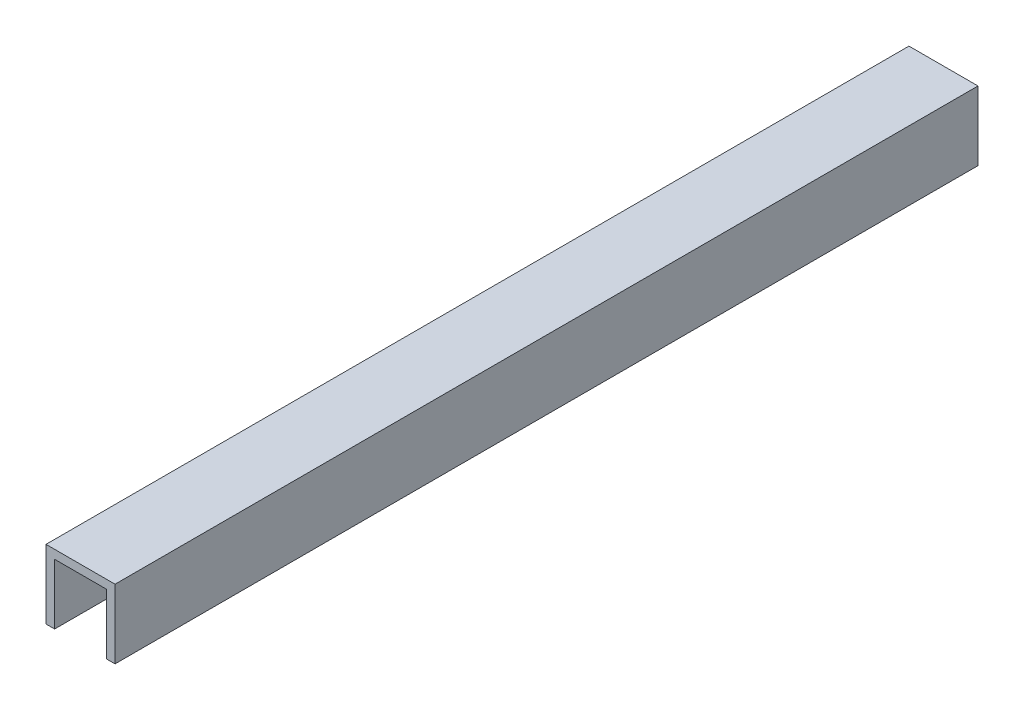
ISO-10303-21;
HEADER;
FILE_DESCRIPTION(('STEP AP214'),'2;1');
FILE_NAME('part.step','',(''),(''),'','','');
FILE_SCHEMA(('AUTOMOTIVE_DESIGN { 1 0 10303 214 1 1 1 1 }'));
ENDSEC;
DATA;
#1=APPLICATION_CONTEXT('core data for automotive mechanical design processes');
#2=APPLICATION_PROTOCOL_DEFINITION('international standard','automotive_design',2000,#1);
#3=PRODUCT_CONTEXT('',#1,'mechanical');
#4=PRODUCT('Part','Part','',(#3));
#5=PRODUCT_RELATED_PRODUCT_CATEGORY('part','',(#4));
#6=PRODUCT_DEFINITION_FORMATION('','',#4);
#7=PRODUCT_DEFINITION_CONTEXT('part definition',#1,'design');
#8=PRODUCT_DEFINITION('design','',#6,#7);
#9=PRODUCT_DEFINITION_SHAPE('','',#8);
#10=(LENGTH_UNIT() NAMED_UNIT(*) SI_UNIT(.MILLI.,.METRE.));
#11=(NAMED_UNIT(*) PLANE_ANGLE_UNIT() SI_UNIT($,.RADIAN.));
#12=(NAMED_UNIT(*) SI_UNIT($,.STERADIAN.) SOLID_ANGLE_UNIT());
#13=UNCERTAINTY_MEASURE_WITH_UNIT(LENGTH_MEASURE(1.E-05),#10,'distance_accuracy_value','');
#14=(GEOMETRIC_REPRESENTATION_CONTEXT(3) GLOBAL_UNCERTAINTY_ASSIGNED_CONTEXT((#13)) GLOBAL_UNIT_ASSIGNED_CONTEXT((#10,
#11,#12)) REPRESENTATION_CONTEXT('',''));
#15=CARTESIAN_POINT('',(0.,0.,0.));
#16=DIRECTION('',(0.,0.,1.));
#17=DIRECTION('',(1.,0.,0.));
#18=AXIS2_PLACEMENT_3D('',#15,#16,#17);
#19=CARTESIAN_POINT('',(4.,-4.,50.));
#20=DIRECTION('',(0.,-1.,0.));
#21=DIRECTION('',(1.,0.,0.));
#22=AXIS2_PLACEMENT_3D('',#19,#20,#21);
#23=PLANE('',#22);
#24=DIRECTION('',(-1.,0.,0.));
#25=VECTOR('',#24,1.);
#26=CARTESIAN_POINT('',(4.,-4.,50.));
#27=LINE('',#26,#25);
#28=CARTESIAN_POINT('',(4.,-4.,50.));
#29=VERTEX_POINT('',#28);
#30=CARTESIAN_POINT('',(3.,-4.,50.));
#31=VERTEX_POINT('',#30);
#32=EDGE_CURVE('E123',#29,#31,#27,.T.);
#33=ORIENTED_EDGE('',*,*,#32,.T.);
#34=DIRECTION('',(0.,0.,-1.));
#35=VECTOR('',#34,1.);
#36=CARTESIAN_POINT('',(3.,-4.,50.));
#37=LINE('',#36,#35);
#38=CARTESIAN_POINT('',(3.,-4.,-50.));
#39=VERTEX_POINT('',#38);
#40=EDGE_CURVE('E112',#31,#39,#37,.T.);
#41=ORIENTED_EDGE('',*,*,#40,.T.);
#42=DIRECTION('',(-1.,0.,0.));
#43=VECTOR('',#42,1.);
#44=CARTESIAN_POINT('',(4.,-4.,-50.));
#45=LINE('',#44,#43);
#46=CARTESIAN_POINT('',(4.,-4.,-50.));
#47=VERTEX_POINT('',#46);
#48=EDGE_CURVE('E121',#47,#39,#45,.T.);
#49=ORIENTED_EDGE('',*,*,#48,.F.);
#50=DIRECTION('',(0.,0.,-1.));
#51=VECTOR('',#50,1.);
#52=CARTESIAN_POINT('',(4.,-4.,50.));
#53=LINE('',#52,#51);
#54=EDGE_CURVE('E59',#29,#47,#53,.T.);
#55=ORIENTED_EDGE('',*,*,#54,.F.);
#56=EDGE_LOOP('',(#33,#41,#49,#55));
#57=FACE_BOUND('',#56,.T.);
#58=ADVANCED_FACE('F35',(#57),#23,.T.);
#59=CARTESIAN_POINT('',(4.,-4.,50.));
#60=DIRECTION('',(-1.,0.,0.));
#61=DIRECTION('',(0.,0.,1.));
#62=AXIS2_PLACEMENT_3D('',#59,#60,#61);
#63=PLANE('',#62);
#64=DIRECTION('',(0.,1.,0.));
#65=VECTOR('',#64,1.);
#66=CARTESIAN_POINT('',(4.,-4.,-50.));
#67=LINE('',#66,#65);
#68=CARTESIAN_POINT('',(4.,4.,-50.));
#69=VERTEX_POINT('',#68);
#70=EDGE_CURVE('E128',#47,#69,#67,.T.);
#71=ORIENTED_EDGE('',*,*,#70,.T.);
#72=DIRECTION('',(0.,0.,-1.));
#73=VECTOR('',#72,1.);
#74=CARTESIAN_POINT('',(4.,4.,50.));
#75=LINE('',#74,#73);
#76=CARTESIAN_POINT('',(4.,4.,50.));
#77=VERTEX_POINT('',#76);
#78=EDGE_CURVE('E11',#77,#69,#75,.T.);
#79=ORIENTED_EDGE('',*,*,#78,.F.);
#80=DIRECTION('',(0.,1.,0.));
#81=VECTOR('',#80,1.);
#82=CARTESIAN_POINT('',(4.,-4.,50.));
#83=LINE('',#82,#81);
#84=EDGE_CURVE('E129',#29,#77,#83,.T.);
#85=ORIENTED_EDGE('',*,*,#84,.F.);
#86=ORIENTED_EDGE('',*,*,#54,.T.);
#87=EDGE_LOOP('',(#71,#79,#85,#86));
#88=FACE_BOUND('',#87,.T.);
#89=ADVANCED_FACE('F37',(#88),#63,.F.);
#90=CARTESIAN_POINT('',(4.,4.,50.));
#91=DIRECTION('',(0.,-1.,0.));
#92=DIRECTION('',(1.,0.,0.));
#93=AXIS2_PLACEMENT_3D('',#90,#91,#92);
#94=PLANE('',#93);
#95=DIRECTION('',(-1.,0.,0.));
#96=VECTOR('',#95,1.);
#97=CARTESIAN_POINT('',(4.,4.,-50.));
#98=LINE('',#97,#96);
#99=CARTESIAN_POINT('',(-4.,4.,-50.));
#100=VERTEX_POINT('',#99);
#101=EDGE_CURVE('E149',#69,#100,#98,.T.);
#102=ORIENTED_EDGE('',*,*,#101,.T.);
#103=DIRECTION('',(0.,0.,-1.));
#104=VECTOR('',#103,1.);
#105=CARTESIAN_POINT('',(-4.,4.,50.));
#106=LINE('',#105,#104);
#107=CARTESIAN_POINT('',(-4.,4.,50.));
#108=VERTEX_POINT('',#107);
#109=EDGE_CURVE('E43',#108,#100,#106,.T.);
#110=ORIENTED_EDGE('',*,*,#109,.F.);
#111=DIRECTION('',(-1.,0.,0.));
#112=VECTOR('',#111,1.);
#113=CARTESIAN_POINT('',(4.,4.,50.));
#114=LINE('',#113,#112);
#115=EDGE_CURVE('E85',#77,#108,#114,.T.);
#116=ORIENTED_EDGE('',*,*,#115,.F.);
#117=ORIENTED_EDGE('',*,*,#78,.T.);
#118=EDGE_LOOP('',(#102,#110,#116,#117));
#119=FACE_BOUND('',#118,.T.);
#120=ADVANCED_FACE('F150',(#119),#94,.F.);
#121=CARTESIAN_POINT('',(-4.,-4.,50.));
#122=DIRECTION('',(-1.,0.,0.));
#123=DIRECTION('',(0.,0.,1.));
#124=AXIS2_PLACEMENT_3D('',#121,#122,#123);
#125=PLANE('',#124);
#126=DIRECTION('',(0.,1.,0.));
#127=VECTOR('',#126,1.);
#128=CARTESIAN_POINT('',(-4.,-4.,-50.));
#129=LINE('',#128,#127);
#130=CARTESIAN_POINT('',(-4.,-4.,-50.));
#131=VERTEX_POINT('',#130);
#132=EDGE_CURVE('E133',#131,#100,#129,.T.);
#133=ORIENTED_EDGE('',*,*,#132,.F.);
#134=DIRECTION('',(0.,0.,-1.));
#135=VECTOR('',#134,1.);
#136=CARTESIAN_POINT('',(-4.,-4.,50.));
#137=LINE('',#136,#135);
#138=CARTESIAN_POINT('',(-4.,-4.,50.));
#139=VERTEX_POINT('',#138);
#140=EDGE_CURVE('E138',#139,#131,#137,.T.);
#141=ORIENTED_EDGE('',*,*,#140,.F.);
#142=DIRECTION('',(0.,1.,0.));
#143=VECTOR('',#142,1.);
#144=CARTESIAN_POINT('',(-4.,-4.,50.));
#145=LINE('',#144,#143);
#146=EDGE_CURVE('E148',#139,#108,#145,.T.);
#147=ORIENTED_EDGE('',*,*,#146,.T.);
#148=ORIENTED_EDGE('',*,*,#109,.T.);
#149=EDGE_LOOP('',(#133,#141,#147,#148));
#150=FACE_BOUND('',#149,.T.);
#151=ADVANCED_FACE('F144',(#150),#125,.T.);
#152=DIRECTION('',(0.,0.,-1.));
#153=VECTOR('',#152,1.);
#154=CARTESIAN_POINT('',(-3.,-4.,50.));
#155=LINE('',#154,#153);
#156=CARTESIAN_POINT('',(-3.,-4.,50.));
#157=VERTEX_POINT('',#156);
#158=CARTESIAN_POINT('',(-3.,-4.,-50.));
#159=VERTEX_POINT('',#158);
#160=EDGE_CURVE('E124',#157,#159,#155,.T.);
#161=ORIENTED_EDGE('',*,*,#160,.F.);
#162=EDGE_CURVE('E157',#157,#139,#27,.T.);
#163=ORIENTED_EDGE('',*,*,#162,.T.);
#164=ORIENTED_EDGE('',*,*,#140,.T.);
#165=EDGE_CURVE('E130',#159,#131,#45,.T.);
#166=ORIENTED_EDGE('',*,*,#165,.F.);
#167=EDGE_LOOP('',(#161,#163,#164,#166));
#168=FACE_BOUND('',#167,.T.);
#169=ADVANCED_FACE('F155',(#168),#23,.T.);
#170=CARTESIAN_POINT('',(0.,0.,50.));
#171=DIRECTION('',(0.,0.,1.));
#172=DIRECTION('',(1.,0.,0.));
#173=AXIS2_PLACEMENT_3D('',#170,#171,#172);
#174=PLANE('',#173);
#175=DIRECTION('',(0.,1.,0.));
#176=VECTOR('',#175,1.);
#177=CARTESIAN_POINT('',(3.,-4.,50.));
#178=LINE('',#177,#176);
#179=CARTESIAN_POINT('',(3.,3.,50.));
#180=VERTEX_POINT('',#179);
#181=EDGE_CURVE('E169',#31,#180,#178,.T.);
#182=ORIENTED_EDGE('',*,*,#181,.F.);
#183=ORIENTED_EDGE('',*,*,#32,.F.);
#184=ORIENTED_EDGE('',*,*,#84,.T.);
#185=ORIENTED_EDGE('',*,*,#115,.T.);
#186=ORIENTED_EDGE('',*,*,#146,.F.);
#187=ORIENTED_EDGE('',*,*,#162,.F.);
#188=DIRECTION('',(0.,1.,0.));
#189=VECTOR('',#188,1.);
#190=CARTESIAN_POINT('',(-3.,-4.,50.));
#191=LINE('',#190,#189);
#192=CARTESIAN_POINT('',(-3.,3.,50.));
#193=VERTEX_POINT('',#192);
#194=EDGE_CURVE('E125',#157,#193,#191,.T.);
#195=ORIENTED_EDGE('',*,*,#194,.T.);
#196=DIRECTION('',(-1.,0.,0.));
#197=VECTOR('',#196,1.);
#198=CARTESIAN_POINT('',(4.,3.,50.));
#199=LINE('',#198,#197);
#200=EDGE_CURVE('E171',#180,#193,#199,.T.);
#201=ORIENTED_EDGE('',*,*,#200,.F.);
#202=EDGE_LOOP('',(#182,#183,#184,#185,#186,#187,#195,#201));
#203=FACE_BOUND('',#202,.T.);
#204=ADVANCED_FACE('F159',(#203),#174,.T.);
#205=CARTESIAN_POINT('',(0.,0.,-50.));
#206=DIRECTION('',(0.,0.,1.));
#207=DIRECTION('',(1.,0.,0.));
#208=AXIS2_PLACEMENT_3D('',#205,#206,#207);
#209=PLANE('',#208);
#210=ORIENTED_EDGE('',*,*,#48,.T.);
#211=DIRECTION('',(0.,1.,0.));
#212=VECTOR('',#211,1.);
#213=CARTESIAN_POINT('',(3.,-4.,-50.));
#214=LINE('',#213,#212);
#215=CARTESIAN_POINT('',(3.,3.,-50.));
#216=VERTEX_POINT('',#215);
#217=EDGE_CURVE('E109',#39,#216,#214,.T.);
#218=ORIENTED_EDGE('',*,*,#217,.T.);
#219=DIRECTION('',(-1.,0.,0.));
#220=VECTOR('',#219,1.);
#221=CARTESIAN_POINT('',(4.,3.,-50.));
#222=LINE('',#221,#220);
#223=CARTESIAN_POINT('',(-3.,3.,-50.));
#224=VERTEX_POINT('',#223);
#225=EDGE_CURVE('E119',#216,#224,#222,.T.);
#226=ORIENTED_EDGE('',*,*,#225,.T.);
#227=DIRECTION('',(0.,1.,0.));
#228=VECTOR('',#227,1.);
#229=CARTESIAN_POINT('',(-3.,-4.,-50.));
#230=LINE('',#229,#228);
#231=EDGE_CURVE('E50',#159,#224,#230,.T.);
#232=ORIENTED_EDGE('',*,*,#231,.F.);
#233=ORIENTED_EDGE('',*,*,#165,.T.);
#234=ORIENTED_EDGE('',*,*,#132,.T.);
#235=ORIENTED_EDGE('',*,*,#101,.F.);
#236=ORIENTED_EDGE('',*,*,#70,.F.);
#237=EDGE_LOOP('',(#210,#218,#226,#232,#233,#234,#235,#236));
#238=FACE_BOUND('',#237,.T.);
#239=ADVANCED_FACE('F127',(#238),#209,.F.);
#240=CARTESIAN_POINT('',(3.,-4.,50.));
#241=DIRECTION('',(-1.,0.,0.));
#242=DIRECTION('',(0.,0.,1.));
#243=AXIS2_PLACEMENT_3D('',#240,#241,#242);
#244=PLANE('',#243);
#245=ORIENTED_EDGE('',*,*,#217,.F.);
#246=ORIENTED_EDGE('',*,*,#40,.F.);
#247=ORIENTED_EDGE('',*,*,#181,.T.);
#248=DIRECTION('',(0.,0.,-1.));
#249=VECTOR('',#248,1.);
#250=CARTESIAN_POINT('',(3.,3.,50.));
#251=LINE('',#250,#249);
#252=EDGE_CURVE('E115',#180,#216,#251,.T.);
#253=ORIENTED_EDGE('',*,*,#252,.T.);
#254=EDGE_LOOP('',(#245,#246,#247,#253));
#255=FACE_BOUND('',#254,.T.);
#256=ADVANCED_FACE('F111',(#255),#244,.T.);
#257=CARTESIAN_POINT('',(4.,3.,50.));
#258=DIRECTION('',(0.,-1.,0.));
#259=DIRECTION('',(1.,0.,0.));
#260=AXIS2_PLACEMENT_3D('',#257,#258,#259);
#261=PLANE('',#260);
#262=ORIENTED_EDGE('',*,*,#225,.F.);
#263=ORIENTED_EDGE('',*,*,#252,.F.);
#264=ORIENTED_EDGE('',*,*,#200,.T.);
#265=DIRECTION('',(0.,0.,-1.));
#266=VECTOR('',#265,1.);
#267=CARTESIAN_POINT('',(-3.,3.,50.));
#268=LINE('',#267,#266);
#269=EDGE_CURVE('E165',#193,#224,#268,.T.);
#270=ORIENTED_EDGE('',*,*,#269,.T.);
#271=EDGE_LOOP('',(#262,#263,#264,#270));
#272=FACE_BOUND('',#271,.T.);
#273=ADVANCED_FACE('F177',(#272),#261,.T.);
#274=CARTESIAN_POINT('',(-3.,-4.,50.));
#275=DIRECTION('',(-1.,0.,0.));
#276=DIRECTION('',(0.,0.,1.));
#277=AXIS2_PLACEMENT_3D('',#274,#275,#276);
#278=PLANE('',#277);
#279=ORIENTED_EDGE('',*,*,#231,.T.);
#280=ORIENTED_EDGE('',*,*,#269,.F.);
#281=ORIENTED_EDGE('',*,*,#194,.F.);
#282=ORIENTED_EDGE('',*,*,#160,.T.);
#283=EDGE_LOOP('',(#279,#280,#281,#282));
#284=FACE_BOUND('',#283,.T.);
#285=ADVANCED_FACE('F179',(#284),#278,.F.);
#286=CLOSED_SHELL('',(#58,#89,#120,#151,#169,#204,#239,#256,#273,#285));
#287=MANIFOLD_SOLID_BREP('B2',#286);
#288=ADVANCED_BREP_SHAPE_REPRESENTATION('',(#18,#287),#14);
#289=SHAPE_DEFINITION_REPRESENTATION(#9,#288);
ENDSEC;
END-ISO-10303-21;
